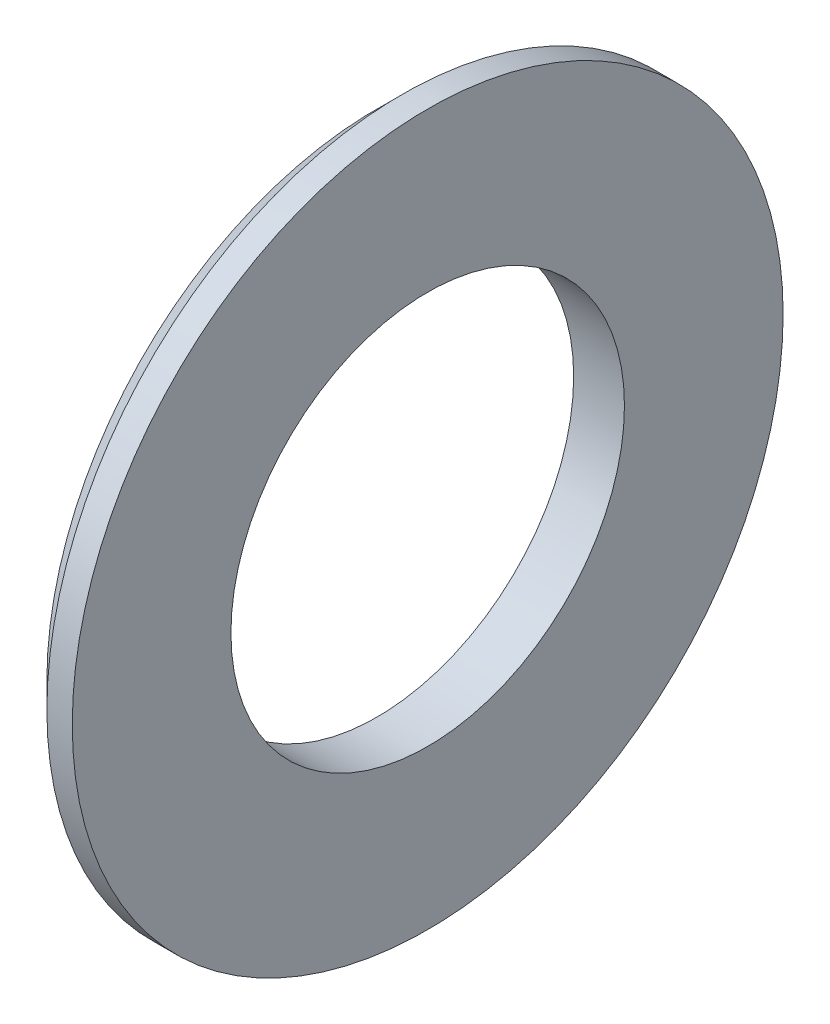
from build123d import *


with BuildPart() as part:
    # Sketch1 → Base-Revolve (revolve)
    with BuildSketch(Plane.XY, mode=Mode.PRIVATE) as base_revolve_sk:
        Polygon((0, 15.5), (0, 28), (-2, 28), (-4, 26), (-4, 15.5), align=None)
    revolve(base_revolve_sk.sketch.rotate(Axis((-34.925, 0, 0), (1, 0, 0)), 90), axis=Axis((-34.925, 0, 0), (1, 0, 0)))


solid = part.part
